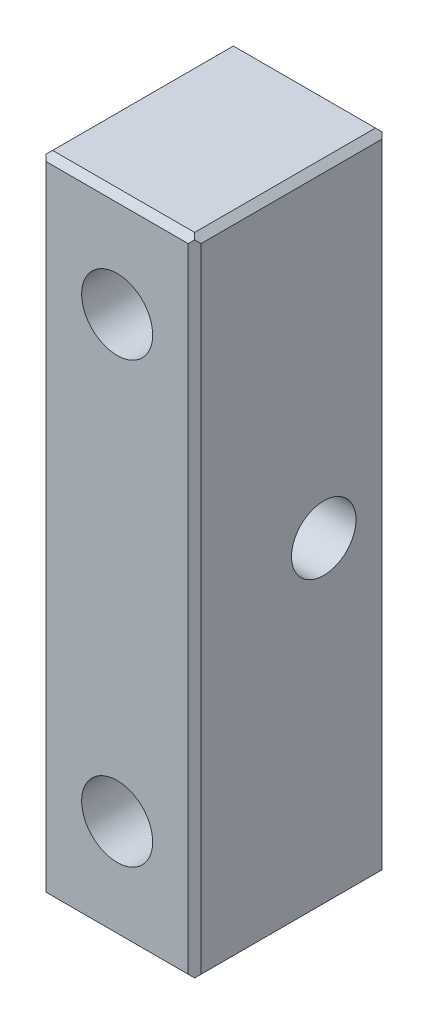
ISO-10303-21;
HEADER;
FILE_DESCRIPTION(('STEP AP214'),'2;1');
FILE_NAME('part.step','',(''),(''),'','','');
FILE_SCHEMA(('AUTOMOTIVE_DESIGN { 1 0 10303 214 1 1 1 1 }'));
ENDSEC;
DATA;
#1=APPLICATION_CONTEXT('core data for automotive mechanical design processes');
#2=APPLICATION_PROTOCOL_DEFINITION('international standard','automotive_design',2000,#1);
#3=PRODUCT_CONTEXT('',#1,'mechanical');
#4=PRODUCT('Part','Part','',(#3));
#5=PRODUCT_RELATED_PRODUCT_CATEGORY('part','',(#4));
#6=PRODUCT_DEFINITION_FORMATION('','',#4);
#7=PRODUCT_DEFINITION_CONTEXT('part definition',#1,'design');
#8=PRODUCT_DEFINITION('design','',#6,#7);
#9=PRODUCT_DEFINITION_SHAPE('','',#8);
#10=(LENGTH_UNIT() NAMED_UNIT(*) SI_UNIT(.MILLI.,.METRE.));
#11=(NAMED_UNIT(*) PLANE_ANGLE_UNIT() SI_UNIT($,.RADIAN.));
#12=(NAMED_UNIT(*) SI_UNIT($,.STERADIAN.) SOLID_ANGLE_UNIT());
#13=UNCERTAINTY_MEASURE_WITH_UNIT(LENGTH_MEASURE(1.E-05),#10,'distance_accuracy_value','');
#14=(GEOMETRIC_REPRESENTATION_CONTEXT(3) GLOBAL_UNCERTAINTY_ASSIGNED_CONTEXT((#13)) GLOBAL_UNIT_ASSIGNED_CONTEXT((#10,
#11,#12)) REPRESENTATION_CONTEXT('',''));
#15=CARTESIAN_POINT('',(0.,0.,0.));
#16=DIRECTION('',(0.,0.,1.));
#17=DIRECTION('',(1.,0.,0.));
#18=AXIS2_PLACEMENT_3D('',#15,#16,#17);
#19=CARTESIAN_POINT('',(325.720096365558,-99.9,179.02));
#20=DIRECTION('',(0.,0.,-1.));
#21=DIRECTION('',(0.,1.,0.));
#22=AXIS2_PLACEMENT_3D('',#19,#20,#21);
#23=PLANE('',#22);
#24=CARTESIAN_POINT('',(325.720096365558,-99.9,179.02));
#25=DIRECTION('',(0.,0.,-1.));
#26=DIRECTION('',(0.,1.,0.));
#27=AXIS2_PLACEMENT_3D('',#24,#25,#26);
#28=CIRCLE('',#27,2.75);
#29=CARTESIAN_POINT('',(325.720096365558,-97.15,179.02));
#30=VERTEX_POINT('',#29);
#31=EDGE_CURVE('E181',#30,#30,#28,.F.);
#32=ORIENTED_EDGE('',*,*,#31,.T.);
#33=EDGE_LOOP('',(#32));
#34=FACE_BOUND('',#33,.T.);
#35=CARTESIAN_POINT('',(325.720096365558,-99.9,179.02));
#36=DIRECTION('',(0.,0.,-1.));
#37=DIRECTION('',(0.,1.,0.));
#38=AXIS2_PLACEMENT_3D('',#35,#36,#37);
#39=CIRCLE('',#38,5.);
#40=CARTESIAN_POINT('',(325.720096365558,-94.9,179.02));
#41=VERTEX_POINT('',#40);
#42=EDGE_CURVE('E19',#41,#41,#39,.T.);
#43=ORIENTED_EDGE('',*,*,#42,.T.);
#44=EDGE_LOOP('',(#43));
#45=FACE_BOUND('',#44,.T.);
#46=ADVANCED_FACE('F16',(#34,#45),#23,.T.);
#47=CARTESIAN_POINT('',(325.720096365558,-65.9,179.02));
#48=DIRECTION('',(0.,0.,-1.));
#49=DIRECTION('',(0.,1.,0.));
#50=AXIS2_PLACEMENT_3D('',#47,#48,#49);
#51=PLANE('',#50);
#52=CARTESIAN_POINT('',(325.720096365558,-65.9,179.02));
#53=DIRECTION('',(0.,0.,-1.));
#54=DIRECTION('',(0.,1.,0.));
#55=AXIS2_PLACEMENT_3D('',#52,#53,#54);
#56=CIRCLE('',#55,2.75);
#57=CARTESIAN_POINT('',(325.720096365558,-63.15,179.02));
#58=VERTEX_POINT('',#57);
#59=EDGE_CURVE('E177',#58,#58,#56,.F.);
#60=ORIENTED_EDGE('',*,*,#59,.T.);
#61=EDGE_LOOP('',(#60));
#62=FACE_BOUND('',#61,.T.);
#63=CARTESIAN_POINT('',(325.720096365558,-65.9,179.02));
#64=DIRECTION('',(0.,0.,-1.));
#65=DIRECTION('',(0.,1.,0.));
#66=AXIS2_PLACEMENT_3D('',#63,#64,#65);
#67=CIRCLE('',#66,5.);
#68=CARTESIAN_POINT('',(325.720096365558,-60.9,179.02));
#69=VERTEX_POINT('',#68);
#70=EDGE_CURVE('E157',#69,#69,#67,.T.);
#71=ORIENTED_EDGE('',*,*,#70,.T.);
#72=EDGE_LOOP('',(#71));
#73=FACE_BOUND('',#72,.T.);
#74=ADVANCED_FACE('F580',(#62,#73),#51,.T.);
#75=CARTESIAN_POINT('',(325.720096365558,-99.9,173.52));
#76=DIRECTION('',(0.,0.,-1.));
#77=DIRECTION('',(0.,1.,0.));
#78=AXIS2_PLACEMENT_3D('',#75,#76,#77);
#79=CYLINDRICAL_SURFACE('',#78,5.);
#80=CARTESIAN_POINT('',(325.720096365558,-99.9,173.52));
#81=DIRECTION('',(0.,0.,-1.));
#82=DIRECTION('',(0.,1.,0.));
#83=AXIS2_PLACEMENT_3D('',#80,#81,#82);
#84=CIRCLE('',#83,5.);
#85=CARTESIAN_POINT('',(325.720096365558,-94.9,173.52));
#86=VERTEX_POINT('',#85);
#87=EDGE_CURVE('E173',#86,#86,#84,.F.);
#88=ORIENTED_EDGE('',*,*,#87,.F.);
#89=EDGE_LOOP('',(#88));
#90=FACE_BOUND('',#89,.T.);
#91=ORIENTED_EDGE('',*,*,#42,.F.);
#92=EDGE_LOOP('',(#91));
#93=FACE_BOUND('',#92,.T.);
#94=ADVANCED_FACE('F570',(#90,#93),#79,.F.);
#95=CARTESIAN_POINT('',(325.720096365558,-65.9,173.52));
#96=DIRECTION('',(0.,0.,-1.));
#97=DIRECTION('',(0.,1.,0.));
#98=AXIS2_PLACEMENT_3D('',#95,#96,#97);
#99=CYLINDRICAL_SURFACE('',#98,5.);
#100=CARTESIAN_POINT('',(325.720096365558,-65.9,173.52));
#101=DIRECTION('',(0.,0.,-1.));
#102=DIRECTION('',(0.,1.,0.));
#103=AXIS2_PLACEMENT_3D('',#100,#101,#102);
#104=CIRCLE('',#103,5.);
#105=CARTESIAN_POINT('',(325.720096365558,-60.9,173.52));
#106=VERTEX_POINT('',#105);
#107=EDGE_CURVE('E169',#106,#106,#104,.F.);
#108=ORIENTED_EDGE('',*,*,#107,.F.);
#109=EDGE_LOOP('',(#108));
#110=FACE_BOUND('',#109,.T.);
#111=ORIENTED_EDGE('',*,*,#70,.F.);
#112=EDGE_LOOP('',(#111));
#113=FACE_BOUND('',#112,.T.);
#114=ADVANCED_FACE('F560',(#110,#113),#99,.F.);
#115=CARTESIAN_POINT('',(319.970096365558,-82.9,173.77));
#116=DIRECTION('',(-0.707106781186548,0.,-0.707106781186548));
#117=DIRECTION('',(-0.707106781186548,0.,0.707106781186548));
#118=AXIS2_PLACEMENT_3D('',#115,#116,#117);
#119=PLANE('',#118);
#120=DIRECTION('',(-0.577350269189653,-0.577350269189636,0.577350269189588));
#121=VECTOR('',#120,1.);
#122=CARTESIAN_POINT('',(319.970096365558,-58.15,173.77));
#123=LINE('',#122,#121);
#124=CARTESIAN_POINT('',(319.970096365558,-58.15,173.77));
#125=VERTEX_POINT('',#124);
#126=CARTESIAN_POINT('',(319.720096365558,-58.4,174.02));
#127=VERTEX_POINT('',#126);
#128=EDGE_CURVE('E183',#125,#127,#123,.T.);
#129=ORIENTED_EDGE('',*,*,#128,.F.);
#130=DIRECTION('',(-0.577350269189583,0.577350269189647,0.577350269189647));
#131=VECTOR('',#130,1.);
#132=CARTESIAN_POINT('',(320.220096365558,-58.4,173.52));
#133=LINE('',#132,#131);
#134=CARTESIAN_POINT('',(320.220096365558,-58.4,173.52));
#135=VERTEX_POINT('',#134);
#136=EDGE_CURVE('E125',#135,#125,#133,.T.);
#137=ORIENTED_EDGE('',*,*,#136,.F.);
#138=DIRECTION('',(0.,1.,0.));
#139=VECTOR('',#138,1.);
#140=CARTESIAN_POINT('',(320.220096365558,-82.9,173.52));
#141=LINE('',#140,#139);
#142=CARTESIAN_POINT('',(320.220096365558,-107.4,173.52));
#143=VERTEX_POINT('',#142);
#144=EDGE_CURVE('E240',#143,#135,#141,.T.);
#145=ORIENTED_EDGE('',*,*,#144,.F.);
#146=DIRECTION('',(0.577350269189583,0.577350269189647,-0.577350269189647));
#147=VECTOR('',#146,1.);
#148=CARTESIAN_POINT('',(319.970096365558,-107.65,173.77));
#149=LINE('',#148,#147);
#150=CARTESIAN_POINT('',(319.970096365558,-107.65,173.77));
#151=VERTEX_POINT('',#150);
#152=EDGE_CURVE('E258',#151,#143,#149,.T.);
#153=ORIENTED_EDGE('',*,*,#152,.F.);
#154=DIRECTION('',(0.577350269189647,-0.577350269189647,-0.577350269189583));
#155=VECTOR('',#154,1.);
#156=CARTESIAN_POINT('',(319.720096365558,-107.4,174.02));
#157=LINE('',#156,#155);
#158=CARTESIAN_POINT('',(319.720096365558,-107.4,174.02));
#159=VERTEX_POINT('',#158);
#160=EDGE_CURVE('E273',#159,#151,#157,.T.);
#161=ORIENTED_EDGE('',*,*,#160,.F.);
#162=DIRECTION('',(0.,-1.,0.));
#163=VECTOR('',#162,1.);
#164=CARTESIAN_POINT('',(319.720096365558,-107.9,174.02));
#165=LINE('',#164,#163);
#166=EDGE_CURVE('E176',#127,#159,#165,.T.);
#167=ORIENTED_EDGE('',*,*,#166,.F.);
#168=EDGE_LOOP('',(#129,#137,#145,#153,#161,#167));
#169=FACE_BOUND('',#168,.T.);
#170=ADVANCED_FACE('F334',(#169),#119,.T.);
#171=CARTESIAN_POINT('',(325.720096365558,-58.15,173.77));
#172=DIRECTION('',(0.,0.707106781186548,-0.707106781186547));
#173=DIRECTION('',(0.,0.707106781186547,0.707106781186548));
#174=AXIS2_PLACEMENT_3D('',#171,#172,#173);
#175=PLANE('',#174);
#176=DIRECTION('',(0.577350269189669,-0.577350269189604,-0.577350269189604));
#177=VECTOR('',#176,1.);
#178=CARTESIAN_POINT('',(331.220096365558,-57.9,174.02));
#179=LINE('',#178,#177);
#180=CARTESIAN_POINT('',(331.220096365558,-57.9,174.02));
#181=VERTEX_POINT('',#180);
#182=CARTESIAN_POINT('',(331.470096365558,-58.15,173.77));
#183=VERTEX_POINT('',#182);
#184=EDGE_CURVE('E141',#181,#183,#179,.T.);
#185=ORIENTED_EDGE('',*,*,#184,.T.);
#186=DIRECTION('',(-0.577350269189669,-0.577350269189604,-0.577350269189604));
#187=VECTOR('',#186,1.);
#188=CARTESIAN_POINT('',(331.470096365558,-58.15,173.77));
#189=LINE('',#188,#187);
#190=CARTESIAN_POINT('',(331.220096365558,-58.4,173.52));
#191=VERTEX_POINT('',#190);
#192=EDGE_CURVE('E130',#183,#191,#189,.T.);
#193=ORIENTED_EDGE('',*,*,#192,.T.);
#194=DIRECTION('',(1.,0.,0.));
#195=VECTOR('',#194,1.);
#196=CARTESIAN_POINT('',(421.720096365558,-58.4,173.52));
#197=LINE('',#196,#195);
#198=EDGE_CURVE('E172',#135,#191,#197,.T.);
#199=ORIENTED_EDGE('',*,*,#198,.F.);
#200=ORIENTED_EDGE('',*,*,#136,.T.);
#201=DIRECTION('',(-0.577350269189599,-0.577350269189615,-0.577350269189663));
#202=VECTOR('',#201,1.);
#203=CARTESIAN_POINT('',(320.220096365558,-57.9,174.02));
#204=LINE('',#203,#202);
#205=CARTESIAN_POINT('',(320.220096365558,-57.9,174.02));
#206=VERTEX_POINT('',#205);
#207=EDGE_CURVE('E140',#206,#125,#204,.T.);
#208=ORIENTED_EDGE('',*,*,#207,.F.);
#209=DIRECTION('',(1.,0.,0.));
#210=VECTOR('',#209,1.);
#211=CARTESIAN_POINT('',(319.720096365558,-57.9,174.02));
#212=LINE('',#211,#210);
#213=EDGE_CURVE('E154',#181,#206,#212,.F.);
#214=ORIENTED_EDGE('',*,*,#213,.F.);
#215=EDGE_LOOP('',(#185,#193,#199,#200,#208,#214));
#216=FACE_BOUND('',#215,.T.);
#217=ADVANCED_FACE('F152',(#216),#175,.T.);
#218=CARTESIAN_POINT('',(319.970096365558,-58.15,181.02));
#219=DIRECTION('',(-0.707106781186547,0.707106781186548,0.));
#220=DIRECTION('',(-0.707106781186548,-0.707106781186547,0.));
#221=AXIS2_PLACEMENT_3D('',#218,#219,#220);
#222=PLANE('',#221);
#223=DIRECTION('',(0.577350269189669,0.577350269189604,0.577350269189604));
#224=VECTOR('',#223,1.);
#225=CARTESIAN_POINT('',(319.720096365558,-58.4,188.02));
#226=LINE('',#225,#224);
#227=CARTESIAN_POINT('',(319.720096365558,-58.4,188.02));
#228=VERTEX_POINT('',#227);
#229=CARTESIAN_POINT('',(319.970096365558,-58.15,188.27));
#230=VERTEX_POINT('',#229);
#231=EDGE_CURVE('E180',#228,#230,#226,.T.);
#232=ORIENTED_EDGE('',*,*,#231,.T.);
#233=DIRECTION('',(0.577350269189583,0.577350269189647,-0.577350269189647));
#234=VECTOR('',#233,1.);
#235=CARTESIAN_POINT('',(319.970096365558,-58.15,188.27));
#236=LINE('',#235,#234);
#237=CARTESIAN_POINT('',(320.220096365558,-57.9,188.02));
#238=VERTEX_POINT('',#237);
#239=EDGE_CURVE('E285',#230,#238,#236,.T.);
#240=ORIENTED_EDGE('',*,*,#239,.T.);
#241=DIRECTION('',(0.,0.,1.));
#242=VECTOR('',#241,1.);
#243=CARTESIAN_POINT('',(320.220096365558,-57.9,173.52));
#244=LINE('',#243,#242);
#245=EDGE_CURVE('E236',#206,#238,#244,.T.);
#246=ORIENTED_EDGE('',*,*,#245,.F.);
#247=ORIENTED_EDGE('',*,*,#207,.T.);
#248=ORIENTED_EDGE('',*,*,#128,.T.);
#249=DIRECTION('',(0.,0.,1.));
#250=VECTOR('',#249,1.);
#251=CARTESIAN_POINT('',(319.720096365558,-58.4,173.52));
#252=LINE('',#251,#250);
#253=EDGE_CURVE('E249',#228,#127,#252,.F.);
#254=ORIENTED_EDGE('',*,*,#253,.F.);
#255=EDGE_LOOP('',(#232,#240,#246,#247,#248,#254));
#256=FACE_BOUND('',#255,.T.);
#257=ADVANCED_FACE('F294',(#256),#222,.T.);
#258=CARTESIAN_POINT('',(325.720096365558,-99.9,173.52));
#259=DIRECTION('',(0.,0.,-1.));
#260=DIRECTION('',(0.,1.,0.));
#261=AXIS2_PLACEMENT_3D('',#258,#259,#260);
#262=CYLINDRICAL_SURFACE('',#261,2.75);
#263=CARTESIAN_POINT('',(325.720096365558,-99.9,188.52));
#264=DIRECTION('',(0.,0.,-1.));
#265=DIRECTION('',(0.,1.,0.));
#266=AXIS2_PLACEMENT_3D('',#263,#264,#265);
#267=CIRCLE('',#266,2.75);
#268=CARTESIAN_POINT('',(325.720096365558,-97.15,188.52));
#269=VERTEX_POINT('',#268);
#270=EDGE_CURVE('E165',#269,#269,#267,.F.);
#271=ORIENTED_EDGE('',*,*,#270,.T.);
#272=EDGE_LOOP('',(#271));
#273=FACE_BOUND('',#272,.T.);
#274=ORIENTED_EDGE('',*,*,#31,.F.);
#275=EDGE_LOOP('',(#274));
#276=FACE_BOUND('',#275,.T.);
#277=ADVANCED_FACE('F525',(#273,#276),#262,.F.);
#278=CARTESIAN_POINT('',(325.720096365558,-65.9,173.52));
#279=DIRECTION('',(0.,0.,-1.));
#280=DIRECTION('',(0.,1.,0.));
#281=AXIS2_PLACEMENT_3D('',#278,#279,#280);
#282=CYLINDRICAL_SURFACE('',#281,2.75);
#283=CARTESIAN_POINT('',(325.720096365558,-65.9,188.52));
#284=DIRECTION('',(0.,0.,-1.));
#285=DIRECTION('',(0.,1.,0.));
#286=AXIS2_PLACEMENT_3D('',#283,#284,#285);
#287=CIRCLE('',#286,2.75);
#288=CARTESIAN_POINT('',(325.720096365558,-63.15,188.52));
#289=VERTEX_POINT('',#288);
#290=EDGE_CURVE('E161',#289,#289,#287,.F.);
#291=ORIENTED_EDGE('',*,*,#290,.T.);
#292=EDGE_LOOP('',(#291));
#293=FACE_BOUND('',#292,.T.);
#294=ORIENTED_EDGE('',*,*,#59,.F.);
#295=EDGE_LOOP('',(#294));
#296=FACE_BOUND('',#295,.T.);
#297=ADVANCED_FACE('F516',(#293,#296),#282,.F.);
#298=CARTESIAN_POINT('',(319.970096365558,-82.9,188.27));
#299=DIRECTION('',(0.707106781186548,0.,-0.707106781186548));
#300=DIRECTION('',(-0.707106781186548,0.,-0.707106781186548));
#301=AXIS2_PLACEMENT_3D('',#298,#299,#300);
#302=PLANE('',#301);
#303=DIRECTION('',(-0.577350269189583,0.577350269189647,-0.577350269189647));
#304=VECTOR('',#303,1.);
#305=CARTESIAN_POINT('',(320.220096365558,-58.4,188.52));
#306=LINE('',#305,#304);
#307=CARTESIAN_POINT('',(320.220096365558,-58.4,188.52));
#308=VERTEX_POINT('',#307);
#309=EDGE_CURVE('E287',#308,#230,#306,.T.);
#310=ORIENTED_EDGE('',*,*,#309,.T.);
#311=ORIENTED_EDGE('',*,*,#231,.F.);
#312=DIRECTION('',(0.,-1.,0.));
#313=VECTOR('',#312,1.);
#314=CARTESIAN_POINT('',(319.720096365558,-107.9,188.02));
#315=LINE('',#314,#313);
#316=CARTESIAN_POINT('',(319.720096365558,-107.4,188.02));
#317=VERTEX_POINT('',#316);
#318=EDGE_CURVE('E252',#317,#228,#315,.F.);
#319=ORIENTED_EDGE('',*,*,#318,.F.);
#320=DIRECTION('',(-0.577350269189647,0.577350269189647,-0.577350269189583));
#321=VECTOR('',#320,1.);
#322=CARTESIAN_POINT('',(319.970096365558,-107.65,188.27));
#323=LINE('',#322,#321);
#324=CARTESIAN_POINT('',(319.970096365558,-107.65,188.27));
#325=VERTEX_POINT('',#324);
#326=EDGE_CURVE('E268',#325,#317,#323,.T.);
#327=ORIENTED_EDGE('',*,*,#326,.F.);
#328=DIRECTION('',(0.577350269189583,0.577350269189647,0.577350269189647));
#329=VECTOR('',#328,1.);
#330=CARTESIAN_POINT('',(319.970096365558,-107.65,188.27));
#331=LINE('',#330,#329);
#332=CARTESIAN_POINT('',(320.220096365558,-107.4,188.52));
#333=VERTEX_POINT('',#332);
#334=EDGE_CURVE('E275',#325,#333,#331,.T.);
#335=ORIENTED_EDGE('',*,*,#334,.T.);
#336=DIRECTION('',(0.,1.,0.));
#337=VECTOR('',#336,1.);
#338=CARTESIAN_POINT('',(320.220096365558,-82.9,188.52));
#339=LINE('',#338,#337);
#340=EDGE_CURVE('E164',#333,#308,#339,.T.);
#341=ORIENTED_EDGE('',*,*,#340,.T.);
#342=EDGE_LOOP('',(#310,#311,#319,#327,#335,#341));
#343=FACE_BOUND('',#342,.T.);
#344=ADVANCED_FACE('F340',(#343),#302,.F.);
#345=CARTESIAN_POINT('',(325.720096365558,-58.15,188.27));
#346=DIRECTION('',(0.,-0.707106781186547,-0.707106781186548));
#347=DIRECTION('',(0.,0.707106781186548,-0.707106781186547));
#348=AXIS2_PLACEMENT_3D('',#345,#346,#347);
#349=PLANE('',#348);
#350=DIRECTION('',(-0.577350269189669,-0.577350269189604,0.577350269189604));
#351=VECTOR('',#350,1.);
#352=CARTESIAN_POINT('',(331.470096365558,-58.15,188.27));
#353=LINE('',#352,#351);
#354=CARTESIAN_POINT('',(331.470096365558,-58.15,188.27));
#355=VERTEX_POINT('',#354);
#356=CARTESIAN_POINT('',(331.220096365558,-58.4,188.52));
#357=VERTEX_POINT('',#356);
#358=EDGE_CURVE('E281',#355,#357,#353,.T.);
#359=ORIENTED_EDGE('',*,*,#358,.F.);
#360=DIRECTION('',(0.577350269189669,-0.577350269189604,0.577350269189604));
#361=VECTOR('',#360,1.);
#362=CARTESIAN_POINT('',(331.220096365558,-57.9,188.02));
#363=LINE('',#362,#361);
#364=CARTESIAN_POINT('',(331.220096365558,-57.9,188.02));
#365=VERTEX_POINT('',#364);
#366=EDGE_CURVE('E283',#365,#355,#363,.T.);
#367=ORIENTED_EDGE('',*,*,#366,.F.);
#368=DIRECTION('',(1.,0.,0.));
#369=VECTOR('',#368,1.);
#370=CARTESIAN_POINT('',(319.720096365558,-57.9,188.02));
#371=LINE('',#370,#369);
#372=EDGE_CURVE('E168',#238,#365,#371,.T.);
#373=ORIENTED_EDGE('',*,*,#372,.F.);
#374=ORIENTED_EDGE('',*,*,#239,.F.);
#375=ORIENTED_EDGE('',*,*,#309,.F.);
#376=DIRECTION('',(1.,0.,0.));
#377=VECTOR('',#376,1.);
#378=CARTESIAN_POINT('',(421.720096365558,-58.4,188.52));
#379=LINE('',#378,#377);
#380=EDGE_CURVE('E230',#308,#357,#379,.T.);
#381=ORIENTED_EDGE('',*,*,#380,.T.);
#382=EDGE_LOOP('',(#359,#367,#373,#374,#375,#381));
#383=FACE_BOUND('',#382,.T.);
#384=ADVANCED_FACE('F306',(#383),#349,.F.);
#385=CARTESIAN_POINT('',(325.720096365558,-107.65,188.27));
#386=DIRECTION('',(0.,0.707106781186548,-0.707106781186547));
#387=DIRECTION('',(0.,0.707106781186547,0.707106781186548));
#388=AXIS2_PLACEMENT_3D('',#385,#386,#387);
#389=PLANE('',#388);
#390=ORIENTED_EDGE('',*,*,#334,.F.);
#391=DIRECTION('',(-0.577350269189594,0.577350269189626,0.577350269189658));
#392=VECTOR('',#391,1.);
#393=CARTESIAN_POINT('',(320.220096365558,-107.9,188.02));
#394=LINE('',#393,#392);
#395=CARTESIAN_POINT('',(320.220096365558,-107.9,188.02));
#396=VERTEX_POINT('',#395);
#397=EDGE_CURVE('E270',#396,#325,#394,.T.);
#398=ORIENTED_EDGE('',*,*,#397,.F.);
#399=DIRECTION('',(1.,0.,0.));
#400=VECTOR('',#399,1.);
#401=CARTESIAN_POINT('',(331.720096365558,-107.9,188.02));
#402=LINE('',#401,#400);
#403=CARTESIAN_POINT('',(331.220096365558,-107.9,188.02));
#404=VERTEX_POINT('',#403);
#405=EDGE_CURVE('E224',#404,#396,#402,.F.);
#406=ORIENTED_EDGE('',*,*,#405,.F.);
#407=DIRECTION('',(-0.577350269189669,-0.577350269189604,-0.577350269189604));
#408=VECTOR('',#407,1.);
#409=CARTESIAN_POINT('',(331.470096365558,-107.65,188.27));
#410=LINE('',#409,#408);
#411=CARTESIAN_POINT('',(331.470096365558,-107.65,188.27));
#412=VERTEX_POINT('',#411);
#413=EDGE_CURVE('E277',#412,#404,#410,.T.);
#414=ORIENTED_EDGE('',*,*,#413,.F.);
#415=DIRECTION('',(0.577350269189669,-0.577350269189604,-0.577350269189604));
#416=VECTOR('',#415,1.);
#417=CARTESIAN_POINT('',(331.220096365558,-107.4,188.52));
#418=LINE('',#417,#416);
#419=CARTESIAN_POINT('',(331.220096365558,-107.4,188.52));
#420=VERTEX_POINT('',#419);
#421=EDGE_CURVE('E279',#420,#412,#418,.T.);
#422=ORIENTED_EDGE('',*,*,#421,.F.);
#423=DIRECTION('',(1.,0.,0.));
#424=VECTOR('',#423,1.);
#425=CARTESIAN_POINT('',(421.720096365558,-107.4,188.52));
#426=LINE('',#425,#424);
#427=EDGE_CURVE('E227',#420,#333,#426,.F.);
#428=ORIENTED_EDGE('',*,*,#427,.T.);
#429=EDGE_LOOP('',(#390,#398,#406,#414,#422,#428));
#430=FACE_BOUND('',#429,.T.);
#431=ADVANCED_FACE('F319',(#430),#389,.F.);
#432=CARTESIAN_POINT('',(319.970096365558,-107.65,181.02));
#433=DIRECTION('',(-0.707106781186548,-0.707106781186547,0.));
#434=DIRECTION('',(0.707106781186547,-0.707106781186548,0.));
#435=AXIS2_PLACEMENT_3D('',#432,#433,#434);
#436=PLANE('',#435);
#437=ORIENTED_EDGE('',*,*,#397,.T.);
#438=ORIENTED_EDGE('',*,*,#326,.T.);
#439=DIRECTION('',(0.,0.,1.));
#440=VECTOR('',#439,1.);
#441=CARTESIAN_POINT('',(319.720096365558,-107.4,173.52));
#442=LINE('',#441,#440);
#443=EDGE_CURVE('E255',#159,#317,#442,.T.);
#444=ORIENTED_EDGE('',*,*,#443,.F.);
#445=ORIENTED_EDGE('',*,*,#160,.T.);
#446=DIRECTION('',(-0.577350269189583,0.577350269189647,-0.577350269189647));
#447=VECTOR('',#446,1.);
#448=CARTESIAN_POINT('',(320.220096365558,-107.9,174.02));
#449=LINE('',#448,#447);
#450=CARTESIAN_POINT('',(320.220096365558,-107.9,174.02));
#451=VERTEX_POINT('',#450);
#452=EDGE_CURVE('E260',#451,#151,#449,.T.);
#453=ORIENTED_EDGE('',*,*,#452,.F.);
#454=DIRECTION('',(0.,0.,-1.));
#455=VECTOR('',#454,1.);
#456=CARTESIAN_POINT('',(320.220096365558,-107.9,173.52));
#457=LINE('',#456,#455);
#458=EDGE_CURVE('E221',#396,#451,#457,.T.);
#459=ORIENTED_EDGE('',*,*,#458,.F.);
#460=EDGE_LOOP('',(#437,#438,#444,#445,#453,#459));
#461=FACE_BOUND('',#460,.T.);
#462=ADVANCED_FACE('F343',(#461),#436,.T.);
#463=CARTESIAN_POINT('',(325.720096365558,-107.65,173.77));
#464=DIRECTION('',(0.,-0.707106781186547,-0.707106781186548));
#465=DIRECTION('',(0.,0.707106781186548,-0.707106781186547));
#466=AXIS2_PLACEMENT_3D('',#463,#464,#465);
#467=PLANE('',#466);
#468=ORIENTED_EDGE('',*,*,#452,.T.);
#469=ORIENTED_EDGE('',*,*,#152,.T.);
#470=DIRECTION('',(1.,0.,0.));
#471=VECTOR('',#470,1.);
#472=CARTESIAN_POINT('',(421.720096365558,-107.4,173.52));
#473=LINE('',#472,#471);
#474=CARTESIAN_POINT('',(331.220096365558,-107.4,173.52));
#475=VERTEX_POINT('',#474);
#476=EDGE_CURVE('E243',#475,#143,#473,.F.);
#477=ORIENTED_EDGE('',*,*,#476,.F.);
#478=DIRECTION('',(0.577350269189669,-0.577350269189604,0.577350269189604));
#479=VECTOR('',#478,1.);
#480=CARTESIAN_POINT('',(331.220096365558,-107.4,173.52));
#481=LINE('',#480,#479);
#482=CARTESIAN_POINT('',(331.470096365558,-107.65,173.77));
#483=VERTEX_POINT('',#482);
#484=EDGE_CURVE('E265',#475,#483,#481,.T.);
#485=ORIENTED_EDGE('',*,*,#484,.T.);
#486=DIRECTION('',(-0.577350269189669,-0.577350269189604,0.577350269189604));
#487=VECTOR('',#486,1.);
#488=CARTESIAN_POINT('',(331.470096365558,-107.65,173.77));
#489=LINE('',#488,#487);
#490=CARTESIAN_POINT('',(331.220096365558,-107.9,174.02));
#491=VERTEX_POINT('',#490);
#492=EDGE_CURVE('E263',#483,#491,#489,.T.);
#493=ORIENTED_EDGE('',*,*,#492,.T.);
#494=DIRECTION('',(1.,0.,0.));
#495=VECTOR('',#494,1.);
#496=CARTESIAN_POINT('',(331.720096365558,-107.9,174.02));
#497=LINE('',#496,#495);
#498=EDGE_CURVE('E218',#451,#491,#497,.T.);
#499=ORIENTED_EDGE('',*,*,#498,.F.);
#500=EDGE_LOOP('',(#468,#469,#477,#485,#493,#499));
#501=FACE_BOUND('',#500,.T.);
#502=ADVANCED_FACE('F327',(#501),#467,.T.);
#503=CARTESIAN_POINT('',(319.720096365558,-107.9,173.52));
#504=DIRECTION('',(-1.,0.,0.));
#505=DIRECTION('',(0.,-1.,0.));
#506=AXIS2_PLACEMENT_3D('',#503,#504,#505);
#507=PLANE('',#506);
#508=CARTESIAN_POINT('',(319.720096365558,-82.9,178.52));
#509=DIRECTION('',(1.,0.,0.));
#510=DIRECTION('',(0.,0.,-1.));
#511=AXIS2_PLACEMENT_3D('',#508,#509,#510);
#512=CIRCLE('',#511,2.5);
#513=CARTESIAN_POINT('',(319.720096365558,-82.9,176.02));
#514=VERTEX_POINT('',#513);
#515=EDGE_CURVE('E188',#514,#514,#512,.T.);
#516=ORIENTED_EDGE('',*,*,#515,.T.);
#517=EDGE_LOOP('',(#516));
#518=FACE_BOUND('',#517,.T.);
#519=ORIENTED_EDGE('',*,*,#253,.T.);
#520=ORIENTED_EDGE('',*,*,#166,.T.);
#521=ORIENTED_EDGE('',*,*,#443,.T.);
#522=ORIENTED_EDGE('',*,*,#318,.T.);
#523=EDGE_LOOP('',(#519,#520,#521,#522));
#524=FACE_BOUND('',#523,.T.);
#525=ADVANCED_FACE('F337',(#518,#524),#507,.T.);
#526=CARTESIAN_POINT('',(421.720096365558,-82.9,173.52));
#527=DIRECTION('',(0.,0.,-1.));
#528=DIRECTION('',(0.,1.,0.));
#529=AXIS2_PLACEMENT_3D('',#526,#527,#528);
#530=PLANE('',#529);
#531=ORIENTED_EDGE('',*,*,#476,.T.);
#532=ORIENTED_EDGE('',*,*,#144,.T.);
#533=ORIENTED_EDGE('',*,*,#198,.T.);
#534=DIRECTION('',(0.,1.,0.));
#535=VECTOR('',#534,1.);
#536=CARTESIAN_POINT('',(331.220096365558,-82.9,173.52));
#537=LINE('',#536,#535);
#538=EDGE_CURVE('E137',#475,#191,#537,.T.);
#539=ORIENTED_EDGE('',*,*,#538,.F.);
#540=EDGE_LOOP('',(#531,#532,#533,#539));
#541=FACE_BOUND('',#540,.T.);
#542=ORIENTED_EDGE('',*,*,#107,.T.);
#543=EDGE_LOOP('',(#542));
#544=FACE_BOUND('',#543,.T.);
#545=ORIENTED_EDGE('',*,*,#87,.T.);
#546=EDGE_LOOP('',(#545));
#547=FACE_BOUND('',#546,.T.);
#548=ADVANCED_FACE('F331',(#541,#544,#547),#530,.T.);
#549=CARTESIAN_POINT('',(319.720096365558,-57.9,173.52));
#550=DIRECTION('',(0.,1.,0.));
#551=DIRECTION('',(0.,0.,1.));
#552=AXIS2_PLACEMENT_3D('',#549,#550,#551);
#553=PLANE('',#552);
#554=ORIENTED_EDGE('',*,*,#245,.T.);
#555=ORIENTED_EDGE('',*,*,#372,.T.);
#556=DIRECTION('',(0.,0.,1.));
#557=VECTOR('',#556,1.);
#558=CARTESIAN_POINT('',(331.220096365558,-57.9,181.02));
#559=LINE('',#558,#557);
#560=EDGE_CURVE('E150',#365,#181,#559,.F.);
#561=ORIENTED_EDGE('',*,*,#560,.T.);
#562=ORIENTED_EDGE('',*,*,#213,.T.);
#563=EDGE_LOOP('',(#554,#555,#561,#562));
#564=FACE_BOUND('',#563,.T.);
#565=ADVANCED_FACE('F300',(#564),#553,.T.);
#566=CARTESIAN_POINT('',(421.720096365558,-82.9,188.52));
#567=DIRECTION('',(0.,0.,-1.));
#568=DIRECTION('',(0.,1.,0.));
#569=AXIS2_PLACEMENT_3D('',#566,#567,#568);
#570=PLANE('',#569);
#571=DIRECTION('',(0.,1.,0.));
#572=VECTOR('',#571,1.);
#573=CARTESIAN_POINT('',(331.220096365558,-82.9,188.52));
#574=LINE('',#573,#572);
#575=EDGE_CURVE('E211',#420,#357,#574,.T.);
#576=ORIENTED_EDGE('',*,*,#575,.T.);
#577=ORIENTED_EDGE('',*,*,#380,.F.);
#578=ORIENTED_EDGE('',*,*,#340,.F.);
#579=ORIENTED_EDGE('',*,*,#427,.F.);
#580=EDGE_LOOP('',(#576,#577,#578,#579));
#581=FACE_BOUND('',#580,.T.);
#582=ORIENTED_EDGE('',*,*,#290,.F.);
#583=EDGE_LOOP('',(#582));
#584=FACE_BOUND('',#583,.T.);
#585=ORIENTED_EDGE('',*,*,#270,.F.);
#586=EDGE_LOOP('',(#585));
#587=FACE_BOUND('',#586,.T.);
#588=ADVANCED_FACE('F312',(#581,#584,#587),#570,.F.);
#589=CARTESIAN_POINT('',(331.720096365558,-107.9,173.52));
#590=DIRECTION('',(0.,-1.,0.));
#591=DIRECTION('',(0.,0.,-1.));
#592=AXIS2_PLACEMENT_3D('',#589,#590,#591);
#593=PLANE('',#592);
#594=ORIENTED_EDGE('',*,*,#458,.T.);
#595=ORIENTED_EDGE('',*,*,#498,.T.);
#596=DIRECTION('',(0.,0.,1.));
#597=VECTOR('',#596,1.);
#598=CARTESIAN_POINT('',(331.220096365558,-107.9,181.02));
#599=LINE('',#598,#597);
#600=EDGE_CURVE('E208',#404,#491,#599,.F.);
#601=ORIENTED_EDGE('',*,*,#600,.F.);
#602=ORIENTED_EDGE('',*,*,#405,.T.);
#603=EDGE_LOOP('',(#594,#595,#601,#602));
#604=FACE_BOUND('',#603,.T.);
#605=ADVANCED_FACE('F323',(#604),#593,.T.);
#606=CARTESIAN_POINT('',(331.470096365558,-82.9,173.77));
#607=DIRECTION('',(0.707106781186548,0.,-0.707106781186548));
#608=DIRECTION('',(-0.707106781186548,0.,-0.707106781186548));
#609=AXIS2_PLACEMENT_3D('',#606,#607,#608);
#610=PLANE('',#609);
#611=DIRECTION('',(0.577350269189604,0.577350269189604,0.577350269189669));
#612=VECTOR('',#611,1.);
#613=CARTESIAN_POINT('',(331.470096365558,-107.65,173.77));
#614=LINE('',#613,#612);
#615=CARTESIAN_POINT('',(331.720096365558,-107.4,174.02));
#616=VERTEX_POINT('',#615);
#617=EDGE_CURVE('E205',#483,#616,#614,.T.);
#618=ORIENTED_EDGE('',*,*,#617,.F.);
#619=ORIENTED_EDGE('',*,*,#484,.F.);
#620=ORIENTED_EDGE('',*,*,#538,.T.);
#621=ORIENTED_EDGE('',*,*,#192,.F.);
#622=DIRECTION('',(0.577350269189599,-0.577350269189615,0.577350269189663));
#623=VECTOR('',#622,1.);
#624=CARTESIAN_POINT('',(331.470096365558,-58.15,173.77));
#625=LINE('',#624,#623);
#626=CARTESIAN_POINT('',(331.720096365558,-58.4,174.02));
#627=VERTEX_POINT('',#626);
#628=EDGE_CURVE('E134',#183,#627,#625,.T.);
#629=ORIENTED_EDGE('',*,*,#628,.T.);
#630=DIRECTION('',(0.,1.,0.));
#631=VECTOR('',#630,1.);
#632=CARTESIAN_POINT('',(331.720096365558,-57.9,174.02));
#633=LINE('',#632,#631);
#634=EDGE_CURVE('E202',#616,#627,#633,.T.);
#635=ORIENTED_EDGE('',*,*,#634,.F.);
#636=EDGE_LOOP('',(#618,#619,#620,#621,#629,#635));
#637=FACE_BOUND('',#636,.T.);
#638=ADVANCED_FACE('F133',(#637),#610,.T.);
#639=CARTESIAN_POINT('',(331.470096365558,-58.15,181.02));
#640=DIRECTION('',(-0.707106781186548,-0.707106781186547,0.));
#641=DIRECTION('',(0.707106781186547,-0.707106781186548,0.));
#642=AXIS2_PLACEMENT_3D('',#639,#640,#641);
#643=PLANE('',#642);
#644=ORIENTED_EDGE('',*,*,#366,.T.);
#645=DIRECTION('',(0.577350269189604,-0.577350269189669,-0.577350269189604));
#646=VECTOR('',#645,1.);
#647=CARTESIAN_POINT('',(331.470096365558,-58.15,188.27));
#648=LINE('',#647,#646);
#649=CARTESIAN_POINT('',(331.720096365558,-58.4,188.02));
#650=VERTEX_POINT('',#649);
#651=EDGE_CURVE('E214',#355,#650,#648,.T.);
#652=ORIENTED_EDGE('',*,*,#651,.T.);
#653=DIRECTION('',(0.,0.,1.));
#654=VECTOR('',#653,1.);
#655=CARTESIAN_POINT('',(331.720096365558,-58.4,173.52));
#656=LINE('',#655,#654);
#657=EDGE_CURVE('E148',#627,#650,#656,.T.);
#658=ORIENTED_EDGE('',*,*,#657,.F.);
#659=ORIENTED_EDGE('',*,*,#628,.F.);
#660=ORIENTED_EDGE('',*,*,#184,.F.);
#661=ORIENTED_EDGE('',*,*,#560,.F.);
#662=EDGE_LOOP('',(#644,#652,#658,#659,#660,#661));
#663=FACE_BOUND('',#662,.T.);
#664=ADVANCED_FACE('F144',(#663),#643,.F.);
#665=CARTESIAN_POINT('',(331.470096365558,-82.9,188.27));
#666=DIRECTION('',(-0.707106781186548,0.,-0.707106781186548));
#667=DIRECTION('',(-0.707106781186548,0.,0.707106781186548));
#668=AXIS2_PLACEMENT_3D('',#665,#666,#667);
#669=PLANE('',#668);
#670=ORIENTED_EDGE('',*,*,#421,.T.);
#671=DIRECTION('',(-0.577350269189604,-0.577350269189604,0.577350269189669));
#672=VECTOR('',#671,1.);
#673=CARTESIAN_POINT('',(331.720096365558,-107.4,188.02));
#674=LINE('',#673,#672);
#675=CARTESIAN_POINT('',(331.720096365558,-107.4,188.02));
#676=VERTEX_POINT('',#675);
#677=EDGE_CURVE('E34',#676,#412,#674,.T.);
#678=ORIENTED_EDGE('',*,*,#677,.F.);
#679=DIRECTION('',(0.,1.,0.));
#680=VECTOR('',#679,1.);
#681=CARTESIAN_POINT('',(331.720096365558,-57.9,188.02));
#682=LINE('',#681,#680);
#683=EDGE_CURVE('E25',#650,#676,#682,.F.);
#684=ORIENTED_EDGE('',*,*,#683,.F.);
#685=ORIENTED_EDGE('',*,*,#651,.F.);
#686=ORIENTED_EDGE('',*,*,#358,.T.);
#687=ORIENTED_EDGE('',*,*,#575,.F.);
#688=EDGE_LOOP('',(#670,#678,#684,#685,#686,#687));
#689=FACE_BOUND('',#688,.T.);
#690=ADVANCED_FACE('F304',(#689),#669,.F.);
#691=CARTESIAN_POINT('',(331.470096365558,-107.65,181.02));
#692=DIRECTION('',(0.707106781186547,-0.707106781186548,0.));
#693=DIRECTION('',(0.707106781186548,0.707106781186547,0.));
#694=AXIS2_PLACEMENT_3D('',#691,#692,#693);
#695=PLANE('',#694);
#696=ORIENTED_EDGE('',*,*,#677,.T.);
#697=ORIENTED_EDGE('',*,*,#413,.T.);
#698=ORIENTED_EDGE('',*,*,#600,.T.);
#699=ORIENTED_EDGE('',*,*,#492,.F.);
#700=ORIENTED_EDGE('',*,*,#617,.T.);
#701=DIRECTION('',(0.,0.,1.));
#702=VECTOR('',#701,1.);
#703=CARTESIAN_POINT('',(331.720096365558,-107.4,173.52));
#704=LINE('',#703,#702);
#705=EDGE_CURVE('E11',#676,#616,#704,.F.);
#706=ORIENTED_EDGE('',*,*,#705,.F.);
#707=EDGE_LOOP('',(#696,#697,#698,#699,#700,#706));
#708=FACE_BOUND('',#707,.T.);
#709=ADVANCED_FACE('F317',(#708),#695,.T.);
#710=CARTESIAN_POINT('',(331.720096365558,-57.9,173.52));
#711=DIRECTION('',(1.,0.,0.));
#712=DIRECTION('',(0.,1.,0.));
#713=AXIS2_PLACEMENT_3D('',#710,#711,#712);
#714=PLANE('',#713);
#715=CARTESIAN_POINT('',(331.720096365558,-82.9,178.52));
#716=DIRECTION('',(1.,0.,0.));
#717=DIRECTION('',(0.,0.,-1.));
#718=AXIS2_PLACEMENT_3D('',#715,#716,#717);
#719=CIRCLE('',#718,2.5);
#720=CARTESIAN_POINT('',(331.720096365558,-82.9,176.02));
#721=VERTEX_POINT('',#720);
#722=EDGE_CURVE('E192',#721,#721,#719,.T.);
#723=ORIENTED_EDGE('',*,*,#722,.F.);
#724=EDGE_LOOP('',(#723));
#725=FACE_BOUND('',#724,.T.);
#726=ORIENTED_EDGE('',*,*,#683,.T.);
#727=ORIENTED_EDGE('',*,*,#705,.T.);
#728=ORIENTED_EDGE('',*,*,#634,.T.);
#729=ORIENTED_EDGE('',*,*,#657,.T.);
#730=EDGE_LOOP('',(#726,#727,#728,#729));
#731=FACE_BOUND('',#730,.T.);
#732=ADVANCED_FACE('F354',(#725,#731),#714,.T.);
#733=CARTESIAN_POINT('',(331.720096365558,-82.9,178.52));
#734=DIRECTION('',(1.,0.,0.));
#735=DIRECTION('',(0.,0.,-1.));
#736=AXIS2_PLACEMENT_3D('',#733,#734,#735);
#737=CYLINDRICAL_SURFACE('',#736,2.5);
#738=ORIENTED_EDGE('',*,*,#515,.F.);
#739=EDGE_LOOP('',(#738));
#740=FACE_BOUND('',#739,.T.);
#741=ORIENTED_EDGE('',*,*,#722,.T.);
#742=EDGE_LOOP('',(#741));
#743=FACE_BOUND('',#742,.T.);
#744=ADVANCED_FACE('F356',(#740,#743),#737,.F.);
#745=CLOSED_SHELL('',(#46,#74,#94,#114,#170,#217,#257,#277,#297,#344,#384,#431,#462,#502,#525,
#548,#565,#588,#605,#638,#664,#690,#709,#732,#744));
#746=MANIFOLD_SOLID_BREP('B1',#745);
#747=ADVANCED_BREP_SHAPE_REPRESENTATION('',(#18,#746),#14);
#748=SHAPE_DEFINITION_REPRESENTATION(#9,#747);
ENDSEC;
END-ISO-10303-21;
